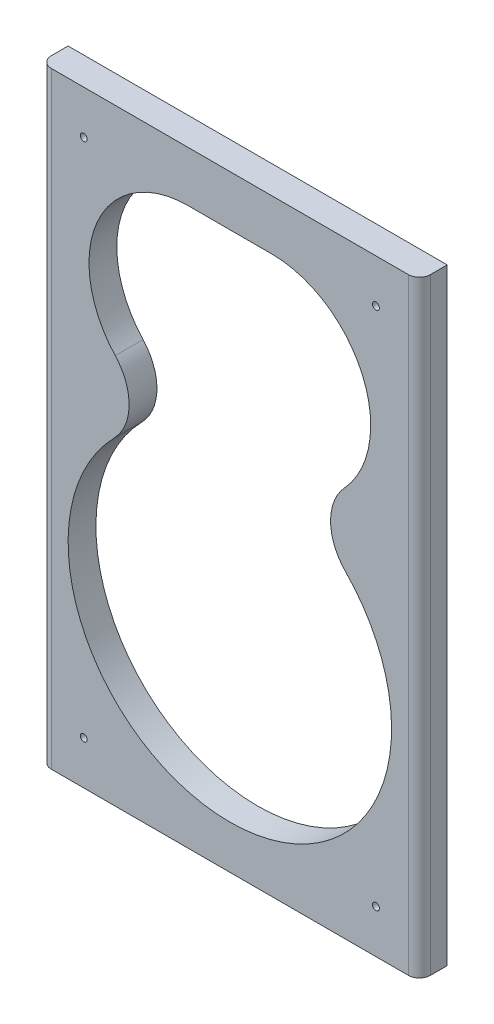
from build123d import *

# Parameters (mm, degrees)
SKETCH_1_W          = 218
SKETCH_1_H          = 349
EXTRUDE_1_DEPTH     = 16
FILLET_1_R          = 6.35
SKETCH_2_R          = 2
CUT_EXTRUDE_1_DEPTH = 16


with BuildPart() as part:
    # Sketch 1 → Extrude 1 (new body)
    with BuildSketch(Plane.XY):
        with Locations((120, 190.5)):
            Rectangle(SKETCH_1_W, SKETCH_1_H)
        with BuildLine():
            Line((96, 336.002673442), (144, 336.002673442))
            ThreePointArc((144, 336.002673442), (196.21276024, 301.86809861), (185.890068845, 240.347503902))
            ThreePointArc((185.890068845, 240.347503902), (177.940627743, 219.567655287), (186.489309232, 199.027067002))
            ThreePointArc((186.489309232, 199.027067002), (120, 41.002673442), (53.510690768, 199.027067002))
            ThreePointArc((53.510690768, 199.027067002), (62.059372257, 219.567655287), (54.109931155, 240.347503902))
            ThreePointArc((54.109931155, 240.347503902), (43.78723976, 301.86809861), (96, 336.002673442))
        make_face(mode=Mode.SUBTRACT)
    extrude(amount=EXTRUDE_1_DEPTH)

    # Fillet 1
    fillet_1_edges = [part.edges().sort_by_distance(p)[0] for p in [
        (229, 190.5, 16),
        (11, 190.5, 16),
    ]]
    fillet(fillet_1_edges, radius=FILLET_1_R)

    # Sketch 2 → Cut-Extrude 1 (cut)
    with BuildSketch(Plane(origin=(0, 0, 0), x_dir=(-1, 0, 0), z_dir=(0, 0, -1))):
        with Locations((-204, 340)):
            Circle(SKETCH_2_R)
        with Locations((-36, 340)):
            Circle(SKETCH_2_R)
        with Locations((-204, 41)):
            Circle(SKETCH_2_R)
        with Locations((-36, 41)):
            Circle(SKETCH_2_R)
    extrude(amount=-CUT_EXTRUDE_1_DEPTH, mode=Mode.SUBTRACT)


solid = part.part
